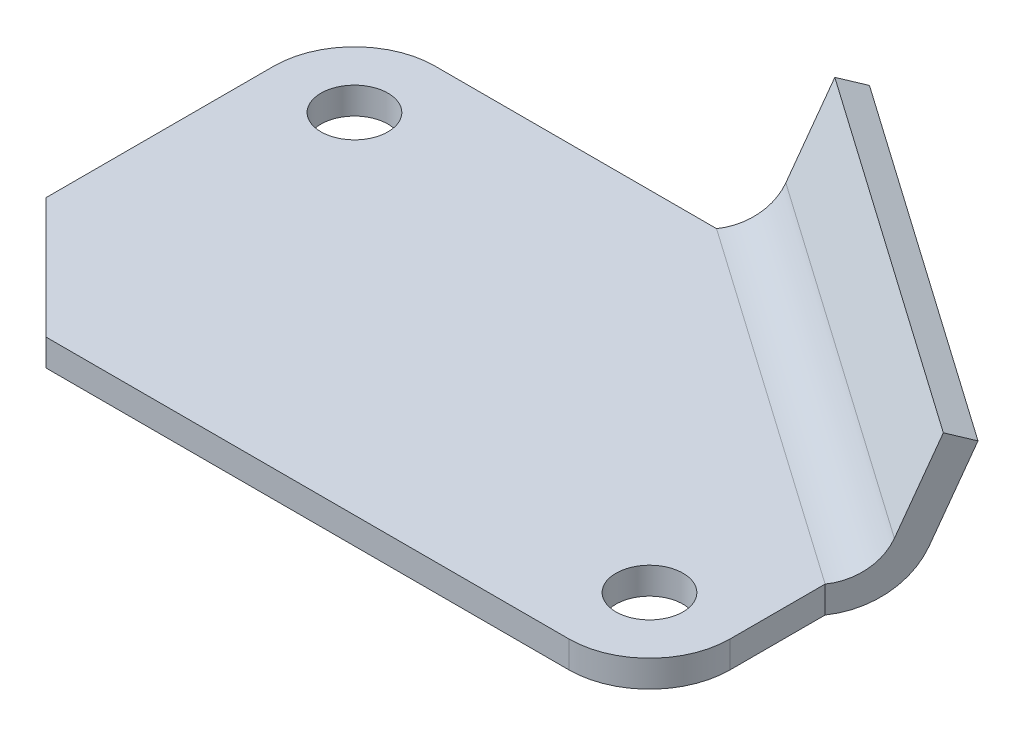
from build123d import *

# Parameters (mm, degrees)
SKETCH2_R           = 5
BOSS_EXTRUDE1_DEPTH = 4
BOSS_EXTRUDE2_DEPTH = 65.921828


with BuildPart() as part:
    # Sketch2 → Boss-Extrude1 (new body)
    with BuildSketch(Plane(origin=(0, 0, 0), x_dir=(1, 0, 0), z_dir=(0, 1, 0))):
        with BuildLine():
            Line((6, -52), (84, -52))
            ThreePointArc((84, -52), (92.485281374, -48.485281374), (96, -40))
            Line((96, -40), (96, -25.811207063))
            Line((96, -25.811207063), (42, 12))
            Line((42, 12), (0, 12))
            ThreePointArc((0, 12), (-8.485281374, 8.485281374), (-12, 0))
            Line((-12, 0), (-12, -34))
            Line((-12, -34), (6, -52))
        make_face()
        with Locations(Location((0, 0, 0), (0, 0, 270))):
            Circle(SKETCH2_R, mode=Mode.SUBTRACT)
        with Locations(Location((84, -40, 0), (0, 0, 270))):
            Circle(SKETCH2_R, mode=Mode.SUBTRACT)
    extrude(amount=-BOSS_EXTRUDE1_DEPTH)

    # Sketch4 → Boss-Extrude2 (add)
    with BuildSketch(Plane(origin=(76.544267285, 0, 53.59687296), x_dir=(0, 1, 0), z_dir=(0.819152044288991, 0, 0.5735764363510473))):
        with BuildLine():
            Line((-4, -33.920034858), (0, -33.920034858))
            ThreePointArc((0, -33.920034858), (1.36769942, -38.393578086), (5.003147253, -41.337505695))
            Line((5.003147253, -41.337505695), (17.983721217, -46.581998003))
            Line((17.983721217, -46.581998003), (16.485294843, -50.290733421))
            Line((16.485294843, -50.290733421), (3.504720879, -45.046241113))
            ThreePointArc((3.504720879, -45.046241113), (-1.948450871, -40.6303497), (-4, -33.920034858))
        make_face()
    extrude(amount=-BOSS_EXTRUDE2_DEPTH)


solid = part.part
